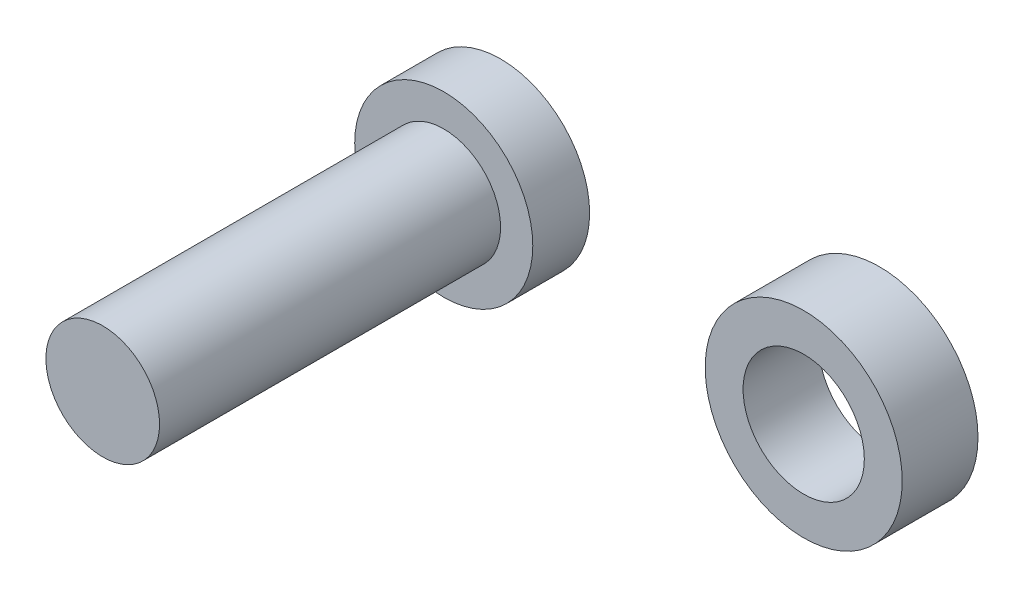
ISO-10303-21;
HEADER;
FILE_DESCRIPTION(('STEP AP214'),'2;1');
FILE_NAME('part.step','',(''),(''),'','','');
FILE_SCHEMA(('AUTOMOTIVE_DESIGN { 1 0 10303 214 1 1 1 1 }'));
ENDSEC;
DATA;
#1=APPLICATION_CONTEXT('core data for automotive mechanical design processes');
#2=APPLICATION_PROTOCOL_DEFINITION('international standard','automotive_design',2000,#1);
#3=PRODUCT_CONTEXT('',#1,'mechanical');
#4=PRODUCT('Part','Part','',(#3));
#5=PRODUCT_RELATED_PRODUCT_CATEGORY('part','',(#4));
#6=PRODUCT_DEFINITION_FORMATION('','',#4);
#7=PRODUCT_DEFINITION_CONTEXT('part definition',#1,'design');
#8=PRODUCT_DEFINITION('design','',#6,#7);
#9=PRODUCT_DEFINITION_SHAPE('','',#8);
#10=(LENGTH_UNIT() NAMED_UNIT(*) SI_UNIT(.MILLI.,.METRE.));
#11=(NAMED_UNIT(*) PLANE_ANGLE_UNIT() SI_UNIT($,.RADIAN.));
#12=(NAMED_UNIT(*) SI_UNIT($,.STERADIAN.) SOLID_ANGLE_UNIT());
#13=UNCERTAINTY_MEASURE_WITH_UNIT(LENGTH_MEASURE(1.E-05),#10,'distance_accuracy_value','');
#14=(GEOMETRIC_REPRESENTATION_CONTEXT(3) GLOBAL_UNCERTAINTY_ASSIGNED_CONTEXT((#13)) GLOBAL_UNIT_ASSIGNED_CONTEXT((#10,
#11,#12)) REPRESENTATION_CONTEXT('',''));
#15=CARTESIAN_POINT('',(0.,0.,0.));
#16=DIRECTION('',(0.,0.,1.));
#17=DIRECTION('',(1.,0.,0.));
#18=AXIS2_PLACEMENT_3D('',#15,#16,#17);
#19=CARTESIAN_POINT('',(10.,0.,2.));
#20=DIRECTION('',(0.,0.,1.));
#21=DIRECTION('',(1.,0.,0.));
#22=AXIS2_PLACEMENT_3D('',#19,#20,#21);
#23=PLANE('',#22);
#24=CARTESIAN_POINT('',(10.,0.,2.));
#25=DIRECTION('',(0.,0.,1.));
#26=DIRECTION('',(1.,0.,0.));
#27=AXIS2_PLACEMENT_3D('',#24,#25,#26);
#28=CIRCLE('',#27,2.6);
#29=CARTESIAN_POINT('',(12.6,0.,2.));
#30=VERTEX_POINT('',#29);
#31=EDGE_CURVE('E11',#30,#30,#28,.T.);
#32=ORIENTED_EDGE('',*,*,#31,.T.);
#33=EDGE_LOOP('',(#32));
#34=FACE_BOUND('',#33,.T.);
#35=CARTESIAN_POINT('',(10.,0.,2.));
#36=DIRECTION('',(0.,0.,1.));
#37=DIRECTION('',(1.,0.,0.));
#38=AXIS2_PLACEMENT_3D('',#35,#36,#37);
#39=CIRCLE('',#38,1.6);
#40=CARTESIAN_POINT('',(11.6,0.,2.));
#41=VERTEX_POINT('',#40);
#42=EDGE_CURVE('E56',#41,#41,#39,.T.);
#43=ORIENTED_EDGE('',*,*,#42,.F.);
#44=EDGE_LOOP('',(#43));
#45=FACE_BOUND('',#44,.T.);
#46=ADVANCED_FACE('F45',(#34,#45),#23,.T.);
#47=CARTESIAN_POINT('',(10.,0.,0.));
#48=DIRECTION('',(0.,0.,1.));
#49=DIRECTION('',(1.,0.,0.));
#50=AXIS2_PLACEMENT_3D('',#47,#48,#49);
#51=PLANE('',#50);
#52=CARTESIAN_POINT('',(10.,0.,0.));
#53=DIRECTION('',(0.,0.,1.));
#54=DIRECTION('',(1.,0.,0.));
#55=AXIS2_PLACEMENT_3D('',#52,#53,#54);
#56=CIRCLE('',#55,2.6);
#57=CARTESIAN_POINT('',(12.6,0.,0.));
#58=VERTEX_POINT('',#57);
#59=EDGE_CURVE('E49',#58,#58,#56,.T.);
#60=ORIENTED_EDGE('',*,*,#59,.F.);
#61=EDGE_LOOP('',(#60));
#62=FACE_BOUND('',#61,.T.);
#63=CARTESIAN_POINT('',(10.,0.,0.));
#64=DIRECTION('',(0.,0.,1.));
#65=DIRECTION('',(1.,0.,0.));
#66=AXIS2_PLACEMENT_3D('',#63,#64,#65);
#67=CIRCLE('',#66,1.6);
#68=CARTESIAN_POINT('',(11.6,0.,0.));
#69=VERTEX_POINT('',#68);
#70=EDGE_CURVE('E58',#69,#69,#67,.T.);
#71=ORIENTED_EDGE('',*,*,#70,.T.);
#72=EDGE_LOOP('',(#71));
#73=FACE_BOUND('',#72,.T.);
#74=ADVANCED_FACE('F68',(#62,#73),#51,.F.);
#75=CARTESIAN_POINT('',(10.,0.,2.));
#76=DIRECTION('',(0.,0.,-1.));
#77=DIRECTION('',(-1.,0.,0.));
#78=AXIS2_PLACEMENT_3D('',#75,#76,#77);
#79=CYLINDRICAL_SURFACE('',#78,2.6);
#80=ORIENTED_EDGE('',*,*,#31,.F.);
#81=EDGE_LOOP('',(#80));
#82=FACE_BOUND('',#81,.T.);
#83=ORIENTED_EDGE('',*,*,#59,.T.);
#84=EDGE_LOOP('',(#83));
#85=FACE_BOUND('',#84,.T.);
#86=ADVANCED_FACE('F47',(#82,#85),#79,.T.);
#87=CARTESIAN_POINT('',(10.,0.,2.));
#88=DIRECTION('',(0.,0.,-1.));
#89=DIRECTION('',(-1.,0.,0.));
#90=AXIS2_PLACEMENT_3D('',#87,#88,#89);
#91=CYLINDRICAL_SURFACE('',#90,1.6);
#92=ORIENTED_EDGE('',*,*,#42,.T.);
#93=EDGE_LOOP('',(#92));
#94=FACE_BOUND('',#93,.T.);
#95=ORIENTED_EDGE('',*,*,#70,.F.);
#96=EDGE_LOOP('',(#95));
#97=FACE_BOUND('',#96,.T.);
#98=ADVANCED_FACE('F64',(#94,#97),#91,.F.);
#99=CLOSED_SHELL('',(#46,#74,#86,#98));
#100=MANIFOLD_SOLID_BREP('B2',#99);
#101=CARTESIAN_POINT('',(0.,0.,1.5));
#102=DIRECTION('',(0.,0.,-1.));
#103=DIRECTION('',(-1.,0.,0.));
#104=AXIS2_PLACEMENT_3D('',#101,#102,#103);
#105=CYLINDRICAL_SURFACE('',#104,2.35);
#106=CARTESIAN_POINT('',(0.,0.,1.5));
#107=DIRECTION('',(0.,0.,1.));
#108=DIRECTION('',(1.,0.,0.));
#109=AXIS2_PLACEMENT_3D('',#106,#107,#108);
#110=CIRCLE('',#109,2.35);
#111=CARTESIAN_POINT('',(2.35,0.,1.5));
#112=VERTEX_POINT('',#111);
#113=EDGE_CURVE('E114',#112,#112,#110,.T.);
#114=ORIENTED_EDGE('',*,*,#113,.F.);
#115=EDGE_LOOP('',(#114));
#116=FACE_BOUND('',#115,.T.);
#117=CARTESIAN_POINT('',(0.,0.,0.));
#118=DIRECTION('',(0.,0.,1.));
#119=DIRECTION('',(1.,0.,0.));
#120=AXIS2_PLACEMENT_3D('',#117,#118,#119);
#121=CIRCLE('',#120,2.35);
#122=CARTESIAN_POINT('',(2.35,0.,0.));
#123=VERTEX_POINT('',#122);
#124=EDGE_CURVE('E110',#123,#123,#121,.T.);
#125=ORIENTED_EDGE('',*,*,#124,.T.);
#126=EDGE_LOOP('',(#125));
#127=FACE_BOUND('',#126,.T.);
#128=ADVANCED_FACE('F107',(#116,#127),#105,.T.);
#129=CARTESIAN_POINT('',(0.,0.,1.5));
#130=DIRECTION('',(0.,0.,1.));
#131=DIRECTION('',(1.,0.,0.));
#132=AXIS2_PLACEMENT_3D('',#129,#130,#131);
#133=PLANE('',#132);
#134=CARTESIAN_POINT('',(0.,0.,1.5));
#135=DIRECTION('',(0.,0.,1.));
#136=DIRECTION('',(1.,0.,0.));
#137=AXIS2_PLACEMENT_3D('',#134,#135,#136);
#138=CIRCLE('',#137,1.5);
#139=CARTESIAN_POINT('',(1.5,0.,1.5));
#140=VERTEX_POINT('',#139);
#141=EDGE_CURVE('E44',#140,#140,#138,.T.);
#142=ORIENTED_EDGE('',*,*,#141,.F.);
#143=EDGE_LOOP('',(#142));
#144=FACE_BOUND('',#143,.T.);
#145=ORIENTED_EDGE('',*,*,#113,.T.);
#146=EDGE_LOOP('',(#145));
#147=FACE_BOUND('',#146,.T.);
#148=ADVANCED_FACE('F131',(#144,#147),#133,.T.);
#149=CARTESIAN_POINT('',(0.,0.,0.));
#150=DIRECTION('',(0.,0.,1.));
#151=DIRECTION('',(1.,0.,0.));
#152=AXIS2_PLACEMENT_3D('',#149,#150,#151);
#153=PLANE('',#152);
#154=ORIENTED_EDGE('',*,*,#124,.F.);
#155=EDGE_LOOP('',(#154));
#156=FACE_BOUND('',#155,.T.);
#157=ADVANCED_FACE('F128',(#156),#153,.F.);
#158=CARTESIAN_POINT('',(0.,0.,10.5));
#159=DIRECTION('',(0.,0.,-1.));
#160=DIRECTION('',(-1.,0.,0.));
#161=AXIS2_PLACEMENT_3D('',#158,#159,#160);
#162=CYLINDRICAL_SURFACE('',#161,1.5);
#163=CARTESIAN_POINT('',(0.,0.,10.5));
#164=DIRECTION('',(0.,0.,1.));
#165=DIRECTION('',(1.,0.,0.));
#166=AXIS2_PLACEMENT_3D('',#163,#164,#165);
#167=CIRCLE('',#166,1.5);
#168=CARTESIAN_POINT('',(1.5,0.,10.5));
#169=VERTEX_POINT('',#168);
#170=EDGE_CURVE('E120',#169,#169,#167,.T.);
#171=ORIENTED_EDGE('',*,*,#170,.F.);
#172=EDGE_LOOP('',(#171));
#173=FACE_BOUND('',#172,.T.);
#174=ORIENTED_EDGE('',*,*,#141,.T.);
#175=EDGE_LOOP('',(#174));
#176=FACE_BOUND('',#175,.T.);
#177=ADVANCED_FACE('F130',(#173,#176),#162,.T.);
#178=CARTESIAN_POINT('',(0.,0.,10.5));
#179=DIRECTION('',(0.,0.,1.));
#180=DIRECTION('',(1.,0.,0.));
#181=AXIS2_PLACEMENT_3D('',#178,#179,#180);
#182=PLANE('',#181);
#183=ORIENTED_EDGE('',*,*,#170,.T.);
#184=EDGE_LOOP('',(#183));
#185=FACE_BOUND('',#184,.T.);
#186=ADVANCED_FACE('F137',(#185),#182,.T.);
#187=CLOSED_SHELL('',(#128,#148,#157,#177,#186));
#188=MANIFOLD_SOLID_BREP('B6',#187);
#189=ADVANCED_BREP_SHAPE_REPRESENTATION('',(#18,#100,#188),#14);
#190=SHAPE_DEFINITION_REPRESENTATION(#9,#189);
ENDSEC;
END-ISO-10303-21;
